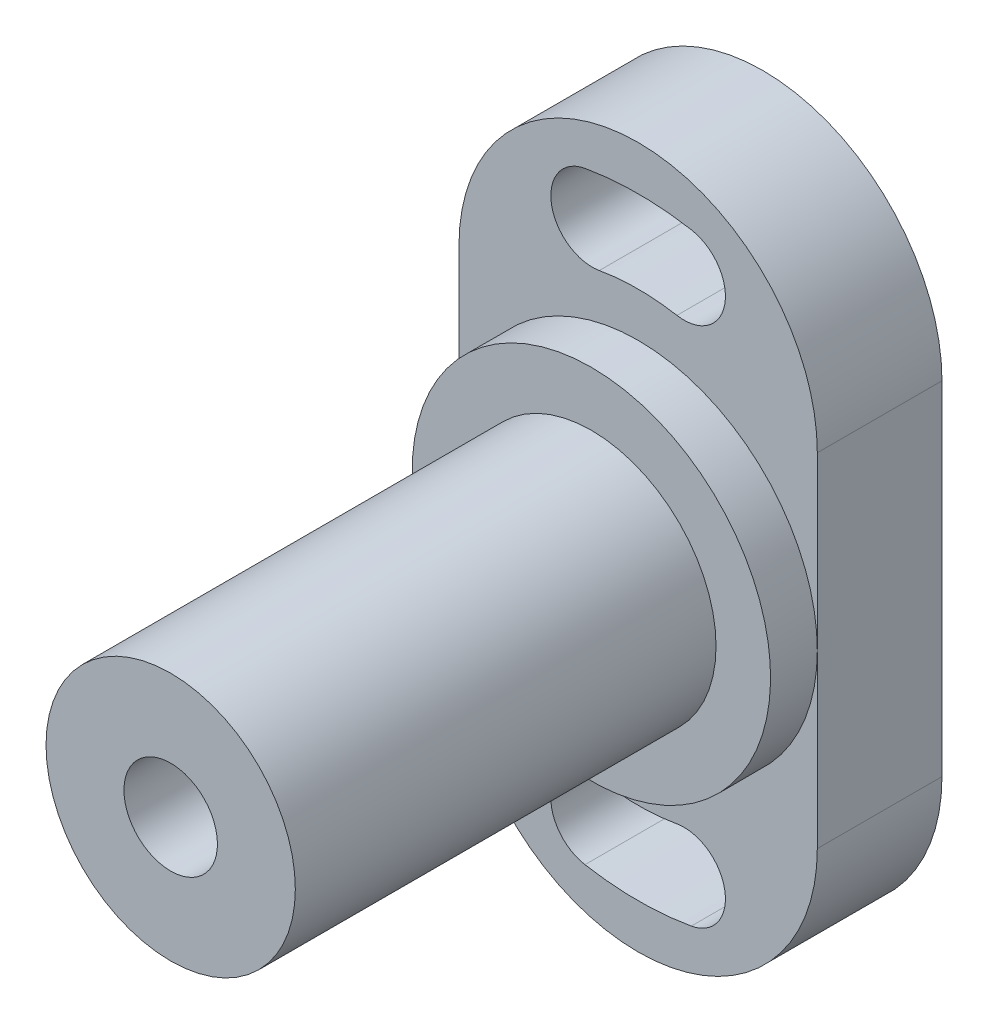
ISO-10303-21;
HEADER;
FILE_DESCRIPTION(('STEP AP214'),'2;1');
FILE_NAME('part.step','',(''),(''),'','','');
FILE_SCHEMA(('AUTOMOTIVE_DESIGN { 1 0 10303 214 1 1 1 1 }'));
ENDSEC;
DATA;
#1=APPLICATION_CONTEXT('core data for automotive mechanical design processes');
#2=APPLICATION_PROTOCOL_DEFINITION('international standard','automotive_design',2000,#1);
#3=PRODUCT_CONTEXT('',#1,'mechanical');
#4=PRODUCT('Part','Part','',(#3));
#5=PRODUCT_RELATED_PRODUCT_CATEGORY('part','',(#4));
#6=PRODUCT_DEFINITION_FORMATION('','',#4);
#7=PRODUCT_DEFINITION_CONTEXT('part definition',#1,'design');
#8=PRODUCT_DEFINITION('design','',#6,#7);
#9=PRODUCT_DEFINITION_SHAPE('','',#8);
#10=(LENGTH_UNIT() NAMED_UNIT(*) SI_UNIT(.MILLI.,.METRE.));
#11=(NAMED_UNIT(*) PLANE_ANGLE_UNIT() SI_UNIT($,.RADIAN.));
#12=(NAMED_UNIT(*) SI_UNIT($,.STERADIAN.) SOLID_ANGLE_UNIT());
#13=UNCERTAINTY_MEASURE_WITH_UNIT(LENGTH_MEASURE(1.E-05),#10,'distance_accuracy_value','');
#14=(GEOMETRIC_REPRESENTATION_CONTEXT(3) GLOBAL_UNCERTAINTY_ASSIGNED_CONTEXT((#13)) GLOBAL_UNIT_ASSIGNED_CONTEXT((#10,
#11,#12)) REPRESENTATION_CONTEXT('',''));
#15=CARTESIAN_POINT('',(0.,0.,0.));
#16=DIRECTION('',(0.,0.,1.));
#17=DIRECTION('',(1.,0.,0.));
#18=AXIS2_PLACEMENT_3D('',#15,#16,#17);
#19=CARTESIAN_POINT('',(0.,11.,8.));
#20=DIRECTION('',(0.,0.,1.));
#21=DIRECTION('',(0.,-1.,0.));
#22=AXIS2_PLACEMENT_3D('',#19,#20,#21);
#23=PLANE('',#22);
#24=CARTESIAN_POINT('',(0.,0.,8.));
#25=DIRECTION('',(0.,0.,-1.));
#26=DIRECTION('',(0.,1.,0.));
#27=AXIS2_PLACEMENT_3D('',#24,#25,#26);
#28=CIRCLE('',#27,11.5);
#29=CARTESIAN_POINT('',(-11.5,0.,8.));
#30=VERTEX_POINT('',#29);
#31=CARTESIAN_POINT('',(11.5,0.,8.));
#32=VERTEX_POINT('',#31);
#33=EDGE_CURVE('E129',#30,#32,#28,.T.);
#34=ORIENTED_EDGE('',*,*,#33,.T.);
#35=DIRECTION('',(0.,1.,0.));
#36=VECTOR('',#35,1.);
#37=CARTESIAN_POINT('',(11.5,11.,8.));
#38=LINE('',#37,#36);
#39=CARTESIAN_POINT('',(11.5,11.,8.));
#40=VERTEX_POINT('',#39);
#41=EDGE_CURVE('E118',#32,#40,#38,.T.);
#42=ORIENTED_EDGE('',*,*,#41,.T.);
#43=CARTESIAN_POINT('',(0.,11.,8.));
#44=DIRECTION('',(0.,0.,1.));
#45=DIRECTION('',(0.,-1.,0.));
#46=AXIS2_PLACEMENT_3D('',#43,#44,#45);
#47=CIRCLE('',#46,11.5);
#48=CARTESIAN_POINT('',(-11.5,11.,8.));
#49=VERTEX_POINT('',#48);
#50=EDGE_CURVE('E213',#40,#49,#47,.T.);
#51=ORIENTED_EDGE('',*,*,#50,.T.);
#52=DIRECTION('',(0.,-1.,0.));
#53=VECTOR('',#52,1.);
#54=CARTESIAN_POINT('',(-11.5,11.,8.));
#55=LINE('',#54,#53);
#56=EDGE_CURVE('E131',#49,#30,#55,.T.);
#57=ORIENTED_EDGE('',*,*,#56,.T.);
#58=EDGE_LOOP('',(#34,#42,#51,#57));
#59=FACE_BOUND('',#58,.T.);
#60=CARTESIAN_POINT('',(-2.95201902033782,16.7417318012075,8.));
#61=DIRECTION('',(0.,0.,1.));
#62=DIRECTION('',(0.,1.,0.));
#63=AXIS2_PLACEMENT_3D('',#60,#61,#62);
#64=CIRCLE('',#63,2.65);
#65=CARTESIAN_POINT('',(-3.41218669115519,19.3514723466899,8.));
#66=VERTEX_POINT('',#65);
#67=CARTESIAN_POINT('',(-2.49185134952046,14.1319912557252,8.));
#68=VERTEX_POINT('',#67);
#69=EDGE_CURVE('E187',#66,#68,#64,.T.);
#70=ORIENTED_EDGE('',*,*,#69,.F.);
#71=CARTESIAN_POINT('',(0.,0.,8.));
#72=DIRECTION('',(0.,0.,1.));
#73=DIRECTION('',(0.,-1.,0.));
#74=AXIS2_PLACEMENT_3D('',#71,#72,#73);
#75=CIRCLE('',#74,19.65);
#76=CARTESIAN_POINT('',(3.41218669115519,19.3514723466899,8.));
#77=VERTEX_POINT('',#76);
#78=EDGE_CURVE('E185',#77,#66,#75,.T.);
#79=ORIENTED_EDGE('',*,*,#78,.F.);
#80=CARTESIAN_POINT('',(2.95201902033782,16.7417318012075,8.));
#81=DIRECTION('',(0.,0.,1.));
#82=DIRECTION('',(0.,-1.,0.));
#83=AXIS2_PLACEMENT_3D('',#80,#81,#82);
#84=CIRCLE('',#83,2.65);
#85=CARTESIAN_POINT('',(2.49185134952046,14.1319912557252,8.));
#86=VERTEX_POINT('',#85);
#87=EDGE_CURVE('E192',#86,#77,#84,.T.);
#88=ORIENTED_EDGE('',*,*,#87,.F.);
#89=CARTESIAN_POINT('',(0.,0.,8.));
#90=DIRECTION('',(0.,0.,-1.));
#91=DIRECTION('',(0.,-1.,0.));
#92=AXIS2_PLACEMENT_3D('',#89,#90,#91);
#93=CIRCLE('',#92,14.35);
#94=EDGE_CURVE('E189',#68,#86,#93,.T.);
#95=ORIENTED_EDGE('',*,*,#94,.F.);
#96=EDGE_LOOP('',(#70,#79,#88,#95));
#97=FACE_BOUND('',#96,.T.);
#98=ADVANCED_FACE('F14',(#59,#97),#23,.T.);
#99=EDGE_CURVE('E30',#32,#30,#28,.T.);
#100=ORIENTED_EDGE('',*,*,#99,.T.);
#101=CARTESIAN_POINT('',(-11.5,-11.,8.));
#102=VERTEX_POINT('',#101);
#103=EDGE_CURVE('E215',#30,#102,#55,.T.);
#104=ORIENTED_EDGE('',*,*,#103,.T.);
#105=CARTESIAN_POINT('',(0.,-11.,8.));
#106=DIRECTION('',(0.,0.,1.));
#107=DIRECTION('',(0.,1.,0.));
#108=AXIS2_PLACEMENT_3D('',#105,#106,#107);
#109=CIRCLE('',#108,11.5);
#110=CARTESIAN_POINT('',(11.5,-11.,8.));
#111=VERTEX_POINT('',#110);
#112=EDGE_CURVE('E113',#102,#111,#109,.T.);
#113=ORIENTED_EDGE('',*,*,#112,.T.);
#114=EDGE_CURVE('E108',#111,#32,#38,.T.);
#115=ORIENTED_EDGE('',*,*,#114,.T.);
#116=EDGE_LOOP('',(#100,#104,#113,#115));
#117=FACE_BOUND('',#116,.T.);
#118=CARTESIAN_POINT('',(0.,0.,8.));
#119=DIRECTION('',(0.,0.,-1.));
#120=DIRECTION('',(0.,1.,0.));
#121=AXIS2_PLACEMENT_3D('',#118,#119,#120);
#122=CIRCLE('',#121,14.35);
#123=CARTESIAN_POINT('',(2.49185134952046,-14.1319912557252,8.));
#124=VERTEX_POINT('',#123);
#125=CARTESIAN_POINT('',(-2.49185134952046,-14.1319912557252,8.));
#126=VERTEX_POINT('',#125);
#127=EDGE_CURVE('E158',#124,#126,#122,.T.);
#128=ORIENTED_EDGE('',*,*,#127,.F.);
#129=CARTESIAN_POINT('',(2.95201902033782,-16.7417318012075,8.));
#130=DIRECTION('',(0.,0.,1.));
#131=DIRECTION('',(0.,1.,0.));
#132=AXIS2_PLACEMENT_3D('',#129,#130,#131);
#133=CIRCLE('',#132,2.65);
#134=CARTESIAN_POINT('',(3.41218669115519,-19.3514723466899,8.));
#135=VERTEX_POINT('',#134);
#136=EDGE_CURVE('E156',#135,#124,#133,.T.);
#137=ORIENTED_EDGE('',*,*,#136,.F.);
#138=CARTESIAN_POINT('',(0.,0.,8.));
#139=DIRECTION('',(0.,0.,1.));
#140=DIRECTION('',(0.,1.,0.));
#141=AXIS2_PLACEMENT_3D('',#138,#139,#140);
#142=CIRCLE('',#141,19.65);
#143=CARTESIAN_POINT('',(-3.41218669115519,-19.3514723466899,8.));
#144=VERTEX_POINT('',#143);
#145=EDGE_CURVE('E162',#144,#135,#142,.T.);
#146=ORIENTED_EDGE('',*,*,#145,.F.);
#147=CARTESIAN_POINT('',(-2.95201902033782,-16.7417318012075,8.));
#148=DIRECTION('',(0.,0.,1.));
#149=DIRECTION('',(0.,-1.,0.));
#150=AXIS2_PLACEMENT_3D('',#147,#148,#149);
#151=CIRCLE('',#150,2.65);
#152=EDGE_CURVE('E160',#126,#144,#151,.T.);
#153=ORIENTED_EDGE('',*,*,#152,.F.);
#154=EDGE_LOOP('',(#128,#137,#146,#153));
#155=FACE_BOUND('',#154,.T.);
#156=ADVANCED_FACE('F110',(#117,#155),#23,.T.);
#157=CARTESIAN_POINT('',(0.,11.,0.));
#158=DIRECTION('',(0.,0.,1.));
#159=DIRECTION('',(0.,-1.,0.));
#160=AXIS2_PLACEMENT_3D('',#157,#158,#159);
#161=PLANE('',#160);
#162=CARTESIAN_POINT('',(0.,0.,0.));
#163=DIRECTION('',(0.,0.,1.));
#164=DIRECTION('',(0.,-1.,0.));
#165=AXIS2_PLACEMENT_3D('',#162,#163,#164);
#166=CIRCLE('',#165,19.65);
#167=CARTESIAN_POINT('',(3.41218669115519,19.3514723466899,0.));
#168=VERTEX_POINT('',#167);
#169=CARTESIAN_POINT('',(-3.41218669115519,19.3514723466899,0.));
#170=VERTEX_POINT('',#169);
#171=EDGE_CURVE('E173',#168,#170,#166,.T.);
#172=ORIENTED_EDGE('',*,*,#171,.T.);
#173=CARTESIAN_POINT('',(-2.95201902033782,16.7417318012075,0.));
#174=DIRECTION('',(0.,0.,1.));
#175=DIRECTION('',(0.,1.,0.));
#176=AXIS2_PLACEMENT_3D('',#173,#174,#175);
#177=CIRCLE('',#176,2.65);
#178=CARTESIAN_POINT('',(-2.49185134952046,14.1319912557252,0.));
#179=VERTEX_POINT('',#178);
#180=EDGE_CURVE('E176',#170,#179,#177,.T.);
#181=ORIENTED_EDGE('',*,*,#180,.T.);
#182=CARTESIAN_POINT('',(0.,0.,0.));
#183=DIRECTION('',(0.,0.,-1.));
#184=DIRECTION('',(0.,-1.,0.));
#185=AXIS2_PLACEMENT_3D('',#182,#183,#184);
#186=CIRCLE('',#185,14.35);
#187=CARTESIAN_POINT('',(2.49185134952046,14.1319912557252,0.));
#188=VERTEX_POINT('',#187);
#189=EDGE_CURVE('E179',#179,#188,#186,.T.);
#190=ORIENTED_EDGE('',*,*,#189,.T.);
#191=CARTESIAN_POINT('',(2.95201902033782,16.7417318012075,0.));
#192=DIRECTION('',(0.,0.,1.));
#193=DIRECTION('',(0.,-1.,0.));
#194=AXIS2_PLACEMENT_3D('',#191,#192,#193);
#195=CIRCLE('',#194,2.65);
#196=EDGE_CURVE('E182',#188,#168,#195,.T.);
#197=ORIENTED_EDGE('',*,*,#196,.T.);
#198=EDGE_LOOP('',(#172,#181,#190,#197));
#199=FACE_BOUND('',#198,.T.);
#200=CARTESIAN_POINT('',(0.,11.,0.));
#201=DIRECTION('',(0.,0.,1.));
#202=DIRECTION('',(0.,-1.,0.));
#203=AXIS2_PLACEMENT_3D('',#200,#201,#202);
#204=CIRCLE('',#203,11.5);
#205=CARTESIAN_POINT('',(11.5,11.,0.));
#206=VERTEX_POINT('',#205);
#207=CARTESIAN_POINT('',(-11.5,11.,0.));
#208=VERTEX_POINT('',#207);
#209=EDGE_CURVE('E204',#206,#208,#204,.T.);
#210=ORIENTED_EDGE('',*,*,#209,.F.);
#211=DIRECTION('',(0.,1.,0.));
#212=VECTOR('',#211,1.);
#213=CARTESIAN_POINT('',(11.5,11.,0.));
#214=LINE('',#213,#212);
#215=CARTESIAN_POINT('',(11.5,-11.,0.));
#216=VERTEX_POINT('',#215);
#217=EDGE_CURVE('E211',#216,#206,#214,.T.);
#218=ORIENTED_EDGE('',*,*,#217,.F.);
#219=CARTESIAN_POINT('',(0.,-11.,0.));
#220=DIRECTION('',(0.,0.,1.));
#221=DIRECTION('',(0.,1.,0.));
#222=AXIS2_PLACEMENT_3D('',#219,#220,#221);
#223=CIRCLE('',#222,11.5);
#224=CARTESIAN_POINT('',(-11.5,-11.,0.));
#225=VERTEX_POINT('',#224);
#226=EDGE_CURVE('E209',#225,#216,#223,.T.);
#227=ORIENTED_EDGE('',*,*,#226,.F.);
#228=DIRECTION('',(0.,-1.,0.));
#229=VECTOR('',#228,1.);
#230=CARTESIAN_POINT('',(-11.5,11.,0.));
#231=LINE('',#230,#229);
#232=EDGE_CURVE('E207',#208,#225,#231,.T.);
#233=ORIENTED_EDGE('',*,*,#232,.F.);
#234=EDGE_LOOP('',(#210,#218,#227,#233));
#235=FACE_BOUND('',#234,.T.);
#236=CARTESIAN_POINT('',(2.95201902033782,-16.7417318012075,0.));
#237=DIRECTION('',(0.,0.,1.));
#238=DIRECTION('',(0.,1.,0.));
#239=AXIS2_PLACEMENT_3D('',#236,#237,#238);
#240=CIRCLE('',#239,2.65);
#241=CARTESIAN_POINT('',(3.41218669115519,-19.3514723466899,0.));
#242=VERTEX_POINT('',#241);
#243=CARTESIAN_POINT('',(2.49185134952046,-14.1319912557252,0.));
#244=VERTEX_POINT('',#243);
#245=EDGE_CURVE('E144',#242,#244,#240,.T.);
#246=ORIENTED_EDGE('',*,*,#245,.T.);
#247=CARTESIAN_POINT('',(0.,0.,0.));
#248=DIRECTION('',(0.,0.,-1.));
#249=DIRECTION('',(0.,1.,0.));
#250=AXIS2_PLACEMENT_3D('',#247,#248,#249);
#251=CIRCLE('',#250,14.35);
#252=CARTESIAN_POINT('',(-2.49185134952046,-14.1319912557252,0.));
#253=VERTEX_POINT('',#252);
#254=EDGE_CURVE('E147',#244,#253,#251,.T.);
#255=ORIENTED_EDGE('',*,*,#254,.T.);
#256=CARTESIAN_POINT('',(-2.95201902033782,-16.7417318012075,0.));
#257=DIRECTION('',(0.,0.,1.));
#258=DIRECTION('',(0.,-1.,0.));
#259=AXIS2_PLACEMENT_3D('',#256,#257,#258);
#260=CIRCLE('',#259,2.65);
#261=CARTESIAN_POINT('',(-3.41218669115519,-19.3514723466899,0.));
#262=VERTEX_POINT('',#261);
#263=EDGE_CURVE('E150',#253,#262,#260,.T.);
#264=ORIENTED_EDGE('',*,*,#263,.T.);
#265=CARTESIAN_POINT('',(0.,0.,0.));
#266=DIRECTION('',(0.,0.,1.));
#267=DIRECTION('',(0.,1.,0.));
#268=AXIS2_PLACEMENT_3D('',#265,#266,#267);
#269=CIRCLE('',#268,19.65);
#270=EDGE_CURVE('E153',#262,#242,#269,.T.);
#271=ORIENTED_EDGE('',*,*,#270,.T.);
#272=EDGE_LOOP('',(#246,#255,#264,#271));
#273=FACE_BOUND('',#272,.T.);
#274=ADVANCED_FACE('F233',(#199,#235,#273),#161,.F.);
#275=CARTESIAN_POINT('',(0.,11.,8.));
#276=DIRECTION('',(0.,0.,-1.));
#277=DIRECTION('',(0.,1.,0.));
#278=AXIS2_PLACEMENT_3D('',#275,#276,#277);
#279=CYLINDRICAL_SURFACE('',#278,11.5);
#280=ORIENTED_EDGE('',*,*,#209,.T.);
#281=DIRECTION('',(0.,0.,-1.));
#282=VECTOR('',#281,1.);
#283=CARTESIAN_POINT('',(-11.5,11.,8.));
#284=LINE('',#283,#282);
#285=EDGE_CURVE('E23',#49,#208,#284,.T.);
#286=ORIENTED_EDGE('',*,*,#285,.F.);
#287=ORIENTED_EDGE('',*,*,#50,.F.);
#288=DIRECTION('',(0.,0.,-1.));
#289=VECTOR('',#288,1.);
#290=CARTESIAN_POINT('',(11.5,11.,8.));
#291=LINE('',#290,#289);
#292=EDGE_CURVE('E117',#40,#206,#291,.T.);
#293=ORIENTED_EDGE('',*,*,#292,.T.);
#294=EDGE_LOOP('',(#280,#286,#287,#293));
#295=FACE_BOUND('',#294,.T.);
#296=ADVANCED_FACE('F16',(#295),#279,.T.);
#297=CARTESIAN_POINT('',(-11.5,11.,8.));
#298=DIRECTION('',(1.,0.,0.));
#299=DIRECTION('',(0.,1.,0.));
#300=AXIS2_PLACEMENT_3D('',#297,#298,#299);
#301=PLANE('',#300);
#302=ORIENTED_EDGE('',*,*,#232,.T.);
#303=DIRECTION('',(0.,0.,-1.));
#304=VECTOR('',#303,1.);
#305=CARTESIAN_POINT('',(-11.5,-11.,8.));
#306=LINE('',#305,#304);
#307=EDGE_CURVE('E221',#102,#225,#306,.T.);
#308=ORIENTED_EDGE('',*,*,#307,.F.);
#309=ORIENTED_EDGE('',*,*,#103,.F.);
#310=ORIENTED_EDGE('',*,*,#56,.F.);
#311=ORIENTED_EDGE('',*,*,#285,.T.);
#312=EDGE_LOOP('',(#302,#308,#309,#310,#311));
#313=FACE_BOUND('',#312,.T.);
#314=ADVANCED_FACE('F227',(#313),#301,.F.);
#315=CARTESIAN_POINT('',(0.,-11.,8.));
#316=DIRECTION('',(0.,0.,-1.));
#317=DIRECTION('',(0.,1.,0.));
#318=AXIS2_PLACEMENT_3D('',#315,#316,#317);
#319=CYLINDRICAL_SURFACE('',#318,11.5);
#320=ORIENTED_EDGE('',*,*,#226,.T.);
#321=DIRECTION('',(0.,0.,-1.));
#322=VECTOR('',#321,1.);
#323=CARTESIAN_POINT('',(11.5,-11.,8.));
#324=LINE('',#323,#322);
#325=EDGE_CURVE('E219',#111,#216,#324,.T.);
#326=ORIENTED_EDGE('',*,*,#325,.F.);
#327=ORIENTED_EDGE('',*,*,#112,.F.);
#328=ORIENTED_EDGE('',*,*,#307,.T.);
#329=EDGE_LOOP('',(#320,#326,#327,#328));
#330=FACE_BOUND('',#329,.T.);
#331=ADVANCED_FACE('F237',(#330),#319,.T.);
#332=CARTESIAN_POINT('',(11.5,11.,8.));
#333=DIRECTION('',(-1.,0.,0.));
#334=DIRECTION('',(0.,-1.,0.));
#335=AXIS2_PLACEMENT_3D('',#332,#333,#334);
#336=PLANE('',#335);
#337=ORIENTED_EDGE('',*,*,#217,.T.);
#338=ORIENTED_EDGE('',*,*,#292,.F.);
#339=ORIENTED_EDGE('',*,*,#41,.F.);
#340=ORIENTED_EDGE('',*,*,#114,.F.);
#341=ORIENTED_EDGE('',*,*,#325,.T.);
#342=EDGE_LOOP('',(#337,#338,#339,#340,#341));
#343=FACE_BOUND('',#342,.T.);
#344=ADVANCED_FACE('F122',(#343),#336,.F.);
#345=CARTESIAN_POINT('',(0.,0.,8.));
#346=DIRECTION('',(0.,0.,-1.));
#347=DIRECTION('',(0.,1.,0.));
#348=AXIS2_PLACEMENT_3D('',#345,#346,#347);
#349=CYLINDRICAL_SURFACE('',#348,19.65);
#350=ORIENTED_EDGE('',*,*,#171,.F.);
#351=DIRECTION('',(0.,0.,-1.));
#352=VECTOR('',#351,1.);
#353=CARTESIAN_POINT('',(3.41218669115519,19.3514723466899,8.));
#354=LINE('',#353,#352);
#355=EDGE_CURVE('E194',#77,#168,#354,.T.);
#356=ORIENTED_EDGE('',*,*,#355,.F.);
#357=ORIENTED_EDGE('',*,*,#78,.T.);
#358=DIRECTION('',(0.,0.,-1.));
#359=VECTOR('',#358,1.);
#360=CARTESIAN_POINT('',(-3.41218669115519,19.3514723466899,8.));
#361=LINE('',#360,#359);
#362=EDGE_CURVE('E201',#66,#170,#361,.T.);
#363=ORIENTED_EDGE('',*,*,#362,.T.);
#364=EDGE_LOOP('',(#350,#356,#357,#363));
#365=FACE_BOUND('',#364,.T.);
#366=ADVANCED_FACE('F246',(#365),#349,.F.);
#367=CARTESIAN_POINT('',(-2.95201902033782,16.7417318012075,8.));
#368=DIRECTION('',(0.,0.,-1.));
#369=DIRECTION('',(0.,1.,0.));
#370=AXIS2_PLACEMENT_3D('',#367,#368,#369);
#371=CYLINDRICAL_SURFACE('',#370,2.65);
#372=ORIENTED_EDGE('',*,*,#180,.F.);
#373=ORIENTED_EDGE('',*,*,#362,.F.);
#374=ORIENTED_EDGE('',*,*,#69,.T.);
#375=DIRECTION('',(0.,0.,-1.));
#376=VECTOR('',#375,1.);
#377=CARTESIAN_POINT('',(-2.49185134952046,14.1319912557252,8.));
#378=LINE('',#377,#376);
#379=EDGE_CURVE('E199',#68,#179,#378,.T.);
#380=ORIENTED_EDGE('',*,*,#379,.T.);
#381=EDGE_LOOP('',(#372,#373,#374,#380));
#382=FACE_BOUND('',#381,.T.);
#383=ADVANCED_FACE('F260',(#382),#371,.F.);
#384=CARTESIAN_POINT('',(0.,0.,8.));
#385=DIRECTION('',(0.,0.,-1.));
#386=DIRECTION('',(0.,1.,0.));
#387=AXIS2_PLACEMENT_3D('',#384,#385,#386);
#388=CYLINDRICAL_SURFACE('',#387,14.35);
#389=ORIENTED_EDGE('',*,*,#189,.F.);
#390=ORIENTED_EDGE('',*,*,#379,.F.);
#391=ORIENTED_EDGE('',*,*,#94,.T.);
#392=DIRECTION('',(0.,0.,-1.));
#393=VECTOR('',#392,1.);
#394=CARTESIAN_POINT('',(2.49185134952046,14.1319912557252,8.));
#395=LINE('',#394,#393);
#396=EDGE_CURVE('E197',#86,#188,#395,.T.);
#397=ORIENTED_EDGE('',*,*,#396,.T.);
#398=EDGE_LOOP('',(#389,#390,#391,#397));
#399=FACE_BOUND('',#398,.T.);
#400=ADVANCED_FACE('F264',(#399),#388,.T.);
#401=CARTESIAN_POINT('',(2.95201902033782,16.7417318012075,8.));
#402=DIRECTION('',(0.,0.,-1.));
#403=DIRECTION('',(0.,1.,0.));
#404=AXIS2_PLACEMENT_3D('',#401,#402,#403);
#405=CYLINDRICAL_SURFACE('',#404,2.65);
#406=ORIENTED_EDGE('',*,*,#196,.F.);
#407=ORIENTED_EDGE('',*,*,#396,.F.);
#408=ORIENTED_EDGE('',*,*,#87,.T.);
#409=ORIENTED_EDGE('',*,*,#355,.T.);
#410=EDGE_LOOP('',(#406,#407,#408,#409));
#411=FACE_BOUND('',#410,.T.);
#412=ADVANCED_FACE('F268',(#411),#405,.F.);
#413=CARTESIAN_POINT('',(2.95201902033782,-16.7417318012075,8.));
#414=DIRECTION('',(0.,0.,-1.));
#415=DIRECTION('',(0.,1.,0.));
#416=AXIS2_PLACEMENT_3D('',#413,#414,#415);
#417=CYLINDRICAL_SURFACE('',#416,2.65);
#418=ORIENTED_EDGE('',*,*,#245,.F.);
#419=DIRECTION('',(0.,0.,-1.));
#420=VECTOR('',#419,1.);
#421=CARTESIAN_POINT('',(3.41218669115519,-19.3514723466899,8.));
#422=LINE('',#421,#420);
#423=EDGE_CURVE('E164',#135,#242,#422,.T.);
#424=ORIENTED_EDGE('',*,*,#423,.F.);
#425=ORIENTED_EDGE('',*,*,#136,.T.);
#426=DIRECTION('',(0.,0.,-1.));
#427=VECTOR('',#426,1.);
#428=CARTESIAN_POINT('',(2.49185134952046,-14.1319912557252,8.));
#429=LINE('',#428,#427);
#430=EDGE_CURVE('E170',#124,#244,#429,.T.);
#431=ORIENTED_EDGE('',*,*,#430,.T.);
#432=EDGE_LOOP('',(#418,#424,#425,#431));
#433=FACE_BOUND('',#432,.T.);
#434=ADVANCED_FACE('F272',(#433),#417,.F.);
#435=CARTESIAN_POINT('',(0.,0.,8.));
#436=DIRECTION('',(0.,0.,-1.));
#437=DIRECTION('',(0.,1.,0.));
#438=AXIS2_PLACEMENT_3D('',#435,#436,#437);
#439=CYLINDRICAL_SURFACE('',#438,14.35);
#440=ORIENTED_EDGE('',*,*,#254,.F.);
#441=ORIENTED_EDGE('',*,*,#430,.F.);
#442=ORIENTED_EDGE('',*,*,#127,.T.);
#443=DIRECTION('',(0.,0.,-1.));
#444=VECTOR('',#443,1.);
#445=CARTESIAN_POINT('',(-2.49185134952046,-14.1319912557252,8.));
#446=LINE('',#445,#444);
#447=EDGE_CURVE('E168',#126,#253,#446,.T.);
#448=ORIENTED_EDGE('',*,*,#447,.T.);
#449=EDGE_LOOP('',(#440,#441,#442,#448));
#450=FACE_BOUND('',#449,.T.);
#451=ADVANCED_FACE('F276',(#450),#439,.T.);
#452=CARTESIAN_POINT('',(-2.95201902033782,-16.7417318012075,8.));
#453=DIRECTION('',(0.,0.,-1.));
#454=DIRECTION('',(0.,1.,0.));
#455=AXIS2_PLACEMENT_3D('',#452,#453,#454);
#456=CYLINDRICAL_SURFACE('',#455,2.65);
#457=ORIENTED_EDGE('',*,*,#263,.F.);
#458=ORIENTED_EDGE('',*,*,#447,.F.);
#459=ORIENTED_EDGE('',*,*,#152,.T.);
#460=DIRECTION('',(0.,0.,-1.));
#461=VECTOR('',#460,1.);
#462=CARTESIAN_POINT('',(-3.41218669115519,-19.3514723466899,8.));
#463=LINE('',#462,#461);
#464=EDGE_CURVE('E38',#144,#262,#463,.T.);
#465=ORIENTED_EDGE('',*,*,#464,.T.);
#466=EDGE_LOOP('',(#457,#458,#459,#465));
#467=FACE_BOUND('',#466,.T.);
#468=ADVANCED_FACE('F280',(#467),#456,.F.);
#469=CARTESIAN_POINT('',(0.,0.,8.));
#470=DIRECTION('',(0.,0.,-1.));
#471=DIRECTION('',(0.,1.,0.));
#472=AXIS2_PLACEMENT_3D('',#469,#470,#471);
#473=CYLINDRICAL_SURFACE('',#472,19.65);
#474=ORIENTED_EDGE('',*,*,#270,.F.);
#475=ORIENTED_EDGE('',*,*,#464,.F.);
#476=ORIENTED_EDGE('',*,*,#145,.T.);
#477=ORIENTED_EDGE('',*,*,#423,.T.);
#478=EDGE_LOOP('',(#474,#475,#476,#477));
#479=FACE_BOUND('',#478,.T.);
#480=ADVANCED_FACE('F284',(#479),#473,.F.);
#481=CARTESIAN_POINT('',(8.,0.,11.));
#482=DIRECTION('',(0.,0.,1.));
#483=DIRECTION('',(0.,-1.,0.));
#484=AXIS2_PLACEMENT_3D('',#481,#482,#483);
#485=PLANE('',#484);
#486=CARTESIAN_POINT('',(0.,0.,11.));
#487=DIRECTION('',(0.,0.,1.));
#488=DIRECTION('',(0.,-1.,0.));
#489=AXIS2_PLACEMENT_3D('',#486,#487,#488);
#490=CIRCLE('',#489,8.);
#491=CARTESIAN_POINT('',(0.,-8.,11.));
#492=VERTEX_POINT('',#491);
#493=EDGE_CURVE('E9',#492,#492,#490,.F.);
#494=ORIENTED_EDGE('',*,*,#493,.T.);
#495=EDGE_LOOP('',(#494));
#496=FACE_BOUND('',#495,.T.);
#497=CARTESIAN_POINT('',(0.,0.,11.));
#498=DIRECTION('',(0.,0.,-1.));
#499=DIRECTION('',(0.,1.,0.));
#500=AXIS2_PLACEMENT_3D('',#497,#498,#499);
#501=CIRCLE('',#500,11.5);
#502=CARTESIAN_POINT('',(0.,11.5,11.));
#503=VERTEX_POINT('',#502);
#504=EDGE_CURVE('E135',#503,#503,#501,.T.);
#505=ORIENTED_EDGE('',*,*,#504,.F.);
#506=EDGE_LOOP('',(#505));
#507=FACE_BOUND('',#506,.T.);
#508=ADVANCED_FACE('F288',(#496,#507),#485,.T.);
#509=CARTESIAN_POINT('',(0.,0.,0.));
#510=DIRECTION('',(0.,0.,-1.));
#511=DIRECTION('',(0.,1.,0.));
#512=AXIS2_PLACEMENT_3D('',#509,#510,#511);
#513=CYLINDRICAL_SURFACE('',#512,11.5);
#514=ORIENTED_EDGE('',*,*,#504,.T.);
#515=EDGE_LOOP('',(#514));
#516=FACE_BOUND('',#515,.T.);
#517=ORIENTED_EDGE('',*,*,#99,.F.);
#518=ORIENTED_EDGE('',*,*,#33,.F.);
#519=EDGE_LOOP('',(#517,#518));
#520=FACE_BOUND('',#519,.T.);
#521=ADVANCED_FACE('F134',(#516,#520),#513,.T.);
#522=CARTESIAN_POINT('',(8.,0.,38.));
#523=DIRECTION('',(0.,0.,1.));
#524=DIRECTION('',(0.,-1.,0.));
#525=AXIS2_PLACEMENT_3D('',#522,#523,#524);
#526=PLANE('',#525);
#527=CARTESIAN_POINT('',(0.,0.,38.));
#528=DIRECTION('',(0.,0.,1.));
#529=DIRECTION('',(0.,-1.,0.));
#530=AXIS2_PLACEMENT_3D('',#527,#528,#529);
#531=CIRCLE('',#530,3.);
#532=CARTESIAN_POINT('',(0.,-3.,38.));
#533=VERTEX_POINT('',#532);
#534=EDGE_CURVE('E18',#533,#533,#531,.T.);
#535=ORIENTED_EDGE('',*,*,#534,.F.);
#536=EDGE_LOOP('',(#535));
#537=FACE_BOUND('',#536,.T.);
#538=CARTESIAN_POINT('',(0.,0.,38.));
#539=DIRECTION('',(0.,0.,-1.));
#540=DIRECTION('',(0.,1.,0.));
#541=AXIS2_PLACEMENT_3D('',#538,#539,#540);
#542=CIRCLE('',#541,8.);
#543=CARTESIAN_POINT('',(0.,8.,38.));
#544=VERTEX_POINT('',#543);
#545=EDGE_CURVE('E137',#544,#544,#542,.T.);
#546=ORIENTED_EDGE('',*,*,#545,.F.);
#547=EDGE_LOOP('',(#546));
#548=FACE_BOUND('',#547,.T.);
#549=ADVANCED_FACE('F289',(#537,#548),#526,.T.);
#550=CARTESIAN_POINT('',(0.,0.,0.));
#551=DIRECTION('',(0.,0.,-1.));
#552=DIRECTION('',(0.,1.,0.));
#553=AXIS2_PLACEMENT_3D('',#550,#551,#552);
#554=CYLINDRICAL_SURFACE('',#553,8.);
#555=ORIENTED_EDGE('',*,*,#493,.F.);
#556=EDGE_LOOP('',(#555));
#557=FACE_BOUND('',#556,.T.);
#558=ORIENTED_EDGE('',*,*,#545,.T.);
#559=EDGE_LOOP('',(#558));
#560=FACE_BOUND('',#559,.T.);
#561=ADVANCED_FACE('F292',(#557,#560),#554,.T.);
#562=CARTESIAN_POINT('',(0.,0.,58.5));
#563=DIRECTION('',(0.,0.,-1.));
#564=DIRECTION('',(0.5,-0.866025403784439,0.));
#565=AXIS2_PLACEMENT_3D('',#562,#563,#564);
#566=CYLINDRICAL_SURFACE('',#565,3.);
#567=ORIENTED_EDGE('',*,*,#534,.T.);
#568=EDGE_LOOP('',(#567));
#569=FACE_BOUND('',#568,.T.);
#570=CARTESIAN_POINT('',(0.,0.,8.5));
#571=DIRECTION('',(0.,0.,-1.));
#572=DIRECTION('',(0.,1.,0.));
#573=AXIS2_PLACEMENT_3D('',#570,#571,#572);
#574=CIRCLE('',#573,3.);
#575=CARTESIAN_POINT('',(0.,3.,8.5));
#576=VERTEX_POINT('',#575);
#577=EDGE_CURVE('E140',#576,#576,#574,.F.);
#578=ORIENTED_EDGE('',*,*,#577,.F.);
#579=EDGE_LOOP('',(#578));
#580=FACE_BOUND('',#579,.T.);
#581=ADVANCED_FACE('F296',(#569,#580),#566,.F.);
#582=CARTESIAN_POINT('',(0.,0.,8.5));
#583=DIRECTION('',(0.,0.,-1.));
#584=DIRECTION('',(0.,1.,0.));
#585=AXIS2_PLACEMENT_3D('',#582,#583,#584);
#586=PLANE('',#585);
#587=ORIENTED_EDGE('',*,*,#577,.T.);
#588=EDGE_LOOP('',(#587));
#589=FACE_BOUND('',#588,.T.);
#590=ADVANCED_FACE('F306',(#589),#586,.F.);
#591=CLOSED_SHELL('',(#98,#156,#274,#296,#314,#331,#344,#366,#383,#400,#412,#434,#451,#468,#480,
#508,#521,#549,#561,#581,#590));
#592=MANIFOLD_SOLID_BREP('B1',#591);
#593=ADVANCED_BREP_SHAPE_REPRESENTATION('',(#18,#592),#14);
#594=SHAPE_DEFINITION_REPRESENTATION(#9,#593);
ENDSEC;
END-ISO-10303-21;
